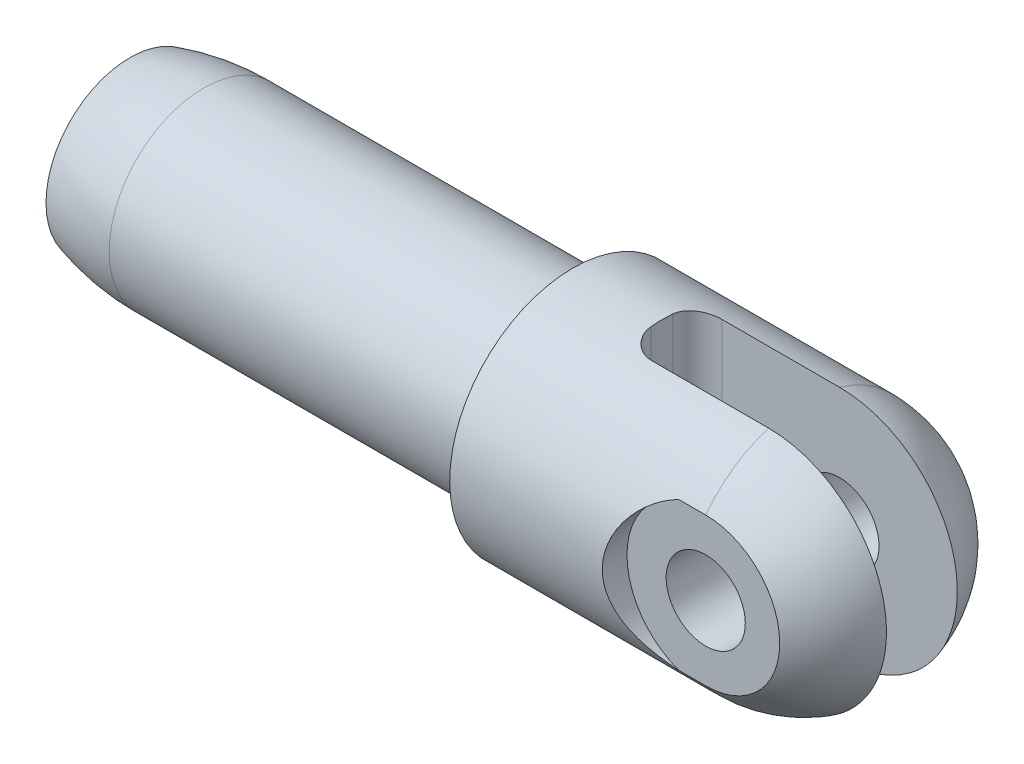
ISO-10303-21;
HEADER;
FILE_DESCRIPTION(('STEP AP214'),'2;1');
FILE_NAME('part.step','',(''),(''),'','','');
FILE_SCHEMA(('AUTOMOTIVE_DESIGN { 1 0 10303 214 1 1 1 1 }'));
ENDSEC;
DATA;
#1=APPLICATION_CONTEXT('core data for automotive mechanical design processes');
#2=APPLICATION_PROTOCOL_DEFINITION('international standard','automotive_design',2000,#1);
#3=PRODUCT_CONTEXT('',#1,'mechanical');
#4=PRODUCT('Part','Part','',(#3));
#5=PRODUCT_RELATED_PRODUCT_CATEGORY('part','',(#4));
#6=PRODUCT_DEFINITION_FORMATION('','',#4);
#7=PRODUCT_DEFINITION_CONTEXT('part definition',#1,'design');
#8=PRODUCT_DEFINITION('design','',#6,#7);
#9=PRODUCT_DEFINITION_SHAPE('','',#8);
#10=(LENGTH_UNIT() NAMED_UNIT(*) SI_UNIT(.MILLI.,.METRE.));
#11=(NAMED_UNIT(*) PLANE_ANGLE_UNIT() SI_UNIT($,.RADIAN.));
#12=(NAMED_UNIT(*) SI_UNIT($,.STERADIAN.) SOLID_ANGLE_UNIT());
#13=UNCERTAINTY_MEASURE_WITH_UNIT(LENGTH_MEASURE(1.E-05),#10,'distance_accuracy_value','');
#14=(GEOMETRIC_REPRESENTATION_CONTEXT(3) GLOBAL_UNCERTAINTY_ASSIGNED_CONTEXT((#13)) GLOBAL_UNIT_ASSIGNED_CONTEXT((#10,
#11,#12)) REPRESENTATION_CONTEXT('',''));
#15=CARTESIAN_POINT('',(0.,0.,0.));
#16=DIRECTION('',(0.,0.,1.));
#17=DIRECTION('',(1.,0.,0.));
#18=AXIS2_PLACEMENT_3D('',#15,#16,#17);
#19=CARTESIAN_POINT('',(-13.6525,0.,0.));
#20=DIRECTION('',(-1.,0.,0.));
#21=DIRECTION('',(0.,0.,-1.));
#22=AXIS2_PLACEMENT_3D('',#19,#20,#21);
#23=SPHERICAL_SURFACE('',#22,7.93749999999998);
#24=CARTESIAN_POINT('',(-13.6525,0.,6.34238));
#25=DIRECTION('',(0.,0.,-1.));
#26=DIRECTION('',(-1.,0.,0.));
#27=AXIS2_PLACEMENT_3D('',#24,#25,#26);
#28=CIRCLE('',#27,4.77264310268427);
#29=CARTESIAN_POINT('',(-13.6525,-4.77264310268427,6.34238));
#30=VERTEX_POINT('',#29);
#31=CARTESIAN_POINT('',(-13.6525,4.77264310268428,6.34237999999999));
#32=VERTEX_POINT('',#31);
#33=EDGE_CURVE('E40',#30,#32,#28,.F.);
#34=ORIENTED_EDGE('',*,*,#33,.F.);
#35=CARTESIAN_POINT('',(-13.6525,0.,0.));
#36=DIRECTION('',(-1.,0.,0.));
#37=DIRECTION('',(0.,0.,1.));
#38=AXIS2_PLACEMENT_3D('',#35,#36,#37);
#39=CIRCLE('',#38,7.93749999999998);
#40=CARTESIAN_POINT('',(-13.6525,-7.60119137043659,2.286));
#41=VERTEX_POINT('',#40);
#42=EDGE_CURVE('E109',#41,#30,#39,.T.);
#43=ORIENTED_EDGE('',*,*,#42,.F.);
#44=CARTESIAN_POINT('',(-13.6525,0.,2.286));
#45=DIRECTION('',(0.,0.,1.));
#46=DIRECTION('',(1.,0.,0.));
#47=AXIS2_PLACEMENT_3D('',#44,#45,#46);
#48=CIRCLE('',#47,7.60119137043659);
#49=CARTESIAN_POINT('',(-13.6525,7.60119137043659,2.286));
#50=VERTEX_POINT('',#49);
#51=EDGE_CURVE('E165',#50,#41,#48,.F.);
#52=ORIENTED_EDGE('',*,*,#51,.F.);
#53=EDGE_CURVE('E110',#32,#50,#39,.T.);
#54=ORIENTED_EDGE('',*,*,#53,.F.);
#55=EDGE_LOOP('',(#34,#43,#52,#54));
#56=FACE_BOUND('',#55,.T.);
#57=ADVANCED_FACE('F15',(#56),#23,.T.);
#58=CARTESIAN_POINT('',(-57.15,0.,0.));
#59=DIRECTION('',(-1.,0.,0.));
#60=DIRECTION('',(0.,0.,1.));
#61=AXIS2_PLACEMENT_3D('',#58,#59,#60);
#62=CYLINDRICAL_SURFACE('',#61,7.9375);
#63=CARTESIAN_POINT('',(-28.575,0.,0.));
#64=DIRECTION('',(-1.,0.,0.));
#65=DIRECTION('',(0.,0.,1.));
#66=AXIS2_PLACEMENT_3D('',#63,#64,#65);
#67=CIRCLE('',#66,7.93750000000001);
#68=CARTESIAN_POINT('',(-28.575,0.,7.93750000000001));
#69=VERTEX_POINT('',#68);
#70=EDGE_CURVE('E283',#69,#69,#67,.T.);
#71=ORIENTED_EDGE('',*,*,#70,.F.);
#72=EDGE_LOOP('',(#71));
#73=FACE_BOUND('',#72,.T.);
#74=CARTESIAN_POINT('',(-13.6525,7.60119137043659,-2.286));
#75=VERTEX_POINT('',#74);
#76=CARTESIAN_POINT('',(-13.6525,2.55269999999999,-7.51582523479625));
#77=VERTEX_POINT('',#76);
#78=EDGE_CURVE('E98',#75,#77,#39,.T.);
#79=ORIENTED_EDGE('',*,*,#78,.T.);
#80=CARTESIAN_POINT('',(-13.6525,2.55269999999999,-7.51582523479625));
#81=CARTESIAN_POINT('',(-13.7222960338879,2.55270902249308,-7.5158146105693));
#82=CARTESIAN_POINT('',(-13.7920860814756,2.54983763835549,-7.51679723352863));
#83=CARTESIAN_POINT('',(-13.9311280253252,2.53840431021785,-7.5206699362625));
#84=CARTESIAN_POINT('',(-14.0003800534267,2.52984380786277,-7.52355953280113));
#85=CARTESIAN_POINT('',(-14.1376632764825,2.50713425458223,-7.53115657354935));
#86=CARTESIAN_POINT('',(-14.2056973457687,2.49300091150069,-7.53585890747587));
#87=CARTESIAN_POINT('',(-14.340246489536,2.45928821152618,-7.54692788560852));
#88=CARTESIAN_POINT('',(-14.4067615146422,2.43970867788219,-7.55329458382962));
#89=CARTESIAN_POINT('',(-14.6032774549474,2.37305373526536,-7.57461051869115));
#90=CARTESIAN_POINT('',(-14.730442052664,2.31802971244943,-7.59178708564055));
#91=CARTESIAN_POINT('',(-14.9737471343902,2.18852112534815,-7.63012555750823));
#92=CARTESIAN_POINT('',(-15.0898813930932,2.11402565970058,-7.65128969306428));
#93=CARTESIAN_POINT('',(-15.3120759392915,1.94478991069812,-7.69607646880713));
#94=CARTESIAN_POINT('',(-15.4176805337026,1.8494654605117,-7.71975699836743));
#95=CARTESIAN_POINT('',(-15.6117119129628,1.64252681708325,-7.76641796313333));
#96=CARTESIAN_POINT('',(-15.7001356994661,1.53090978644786,-7.78939827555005));
#97=CARTESIAN_POINT('',(-15.859349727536,1.29123020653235,-7.83273852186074));
#98=CARTESIAN_POINT('',(-15.9296635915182,1.1628361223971,-7.85302194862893));
#99=CARTESIAN_POINT('',(-16.0475142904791,0.895285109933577,-7.88799968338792));
#100=CARTESIAN_POINT('',(-16.0950576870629,0.756131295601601,-7.90269560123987));
#101=CARTESIAN_POINT('',(-16.1644798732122,0.475814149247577,-7.92443165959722));
#102=CARTESIAN_POINT('',(-16.1871437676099,0.334863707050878,-7.93170545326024));
#103=CARTESIAN_POINT('',(-16.2086549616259,0.0509827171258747,-7.93860480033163));
#104=CARTESIAN_POINT('',(-16.2075075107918,-0.091947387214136,-7.93823203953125));
#105=CARTESIAN_POINT('',(-16.1819362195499,-0.370186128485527,-7.93004079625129));
#106=CARTESIAN_POINT('',(-16.1583645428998,-0.505582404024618,-7.92249491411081));
#107=CARTESIAN_POINT('',(-16.0900172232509,-0.770382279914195,-7.90114370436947));
#108=CARTESIAN_POINT('',(-16.0452404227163,-0.899785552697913,-7.88733803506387));
#109=CARTESIAN_POINT('',(-15.935227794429,-1.15085074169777,-7.85466052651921));
#110=CARTESIAN_POINT('',(-15.8697401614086,-1.27239392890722,-7.83572676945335));
#111=CARTESIAN_POINT('',(-15.7203692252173,-1.50302436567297,-7.79477796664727));
#112=CARTESIAN_POINT('',(-15.6364812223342,-1.61210842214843,-7.77276213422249));
#113=CARTESIAN_POINT('',(-15.4483604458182,-1.8197922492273,-7.72684123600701));
#114=CARTESIAN_POINT('',(-15.3433959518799,-1.91772113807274,-7.7028956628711));
#115=CARTESIAN_POINT('',(-15.1182934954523,-2.09481183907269,-7.65663571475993));
#116=CARTESIAN_POINT('',(-14.998150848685,-2.17396783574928,-7.63432184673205));
#117=CARTESIAN_POINT('',(-14.7440846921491,-2.31212129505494,-7.59363371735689));
#118=CARTESIAN_POINT('',(-14.6100027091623,-2.37084409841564,-7.57531428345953));
#119=CARTESIAN_POINT('',(-14.3331895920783,-2.46459128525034,-7.54534011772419));
#120=CARTESIAN_POINT('',(-14.1904723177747,-2.49965260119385,-7.53367500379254));
#121=CARTESIAN_POINT('',(-13.9807346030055,-2.53236915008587,-7.52270597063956));
#122=CARTESIAN_POINT('',(-13.9153032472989,-2.53999094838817,-7.52013238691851));
#123=CARTESIAN_POINT('',(-13.7840927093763,-2.55015256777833,-7.5166912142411));
#124=CARTESIAN_POINT('',(-13.7183141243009,-2.55269931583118,-7.5158212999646));
#125=CARTESIAN_POINT('',(-13.6525,-2.55269999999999,-7.51582523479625));
#126=B_SPLINE_CURVE_WITH_KNOTS('',3,(#80,#81,#82,#83,#84,#85,#86,#87,#88,#89,#90,#91,#92,#93,
#94,#95,#96,#97,#98,#99,#100,#101,#102,#103,#104,#105,#106,#107,#108,#109,#110,#111,#112,#113,
#114,#115,#116,#117,#118,#119,#120,#121,#122,#123,#124,#125),.UNSPECIFIED.,.F.,.F.,(4,2,2,2,2,2,
2,2,2,2,2,2,2,2,2,2,2,2,2,2,2,2,4),(0.,0.209312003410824,0.418570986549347,0.627244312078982,
0.835924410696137,1.25270448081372,1.6697183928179,2.10041801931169,2.53119274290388,
2.9723501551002,3.41338036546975,3.84005320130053,4.2666319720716,4.67762150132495,
5.08863346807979,5.50484822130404,5.92116940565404,6.35577525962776,6.79051557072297,
7.23089225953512,7.67057997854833,7.86816732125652,8.0654847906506),.UNSPECIFIED.);
#127=CARTESIAN_POINT('',(-13.6525,-2.55269999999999,-7.51582523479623));
#128=VERTEX_POINT('',#127);
#129=EDGE_CURVE('E10',#77,#128,#126,.T.);
#130=ORIENTED_EDGE('',*,*,#129,.T.);
#131=CARTESIAN_POINT('',(-13.6525,-7.60119137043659,-2.286));
#132=VERTEX_POINT('',#131);
#133=EDGE_CURVE('E99',#128,#132,#39,.T.);
#134=ORIENTED_EDGE('',*,*,#133,.T.);
#135=DIRECTION('',(-1.,0.,0.));
#136=VECTOR('',#135,1.);
#137=CARTESIAN_POINT('',(-57.15,-7.60119137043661,-2.28599999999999));
#138=LINE('',#137,#136);
#139=CARTESIAN_POINT('',(-21.2287612,-7.60119137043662,-2.286));
#140=VERTEX_POINT('',#139);
#141=EDGE_CURVE('E123',#132,#140,#138,.T.);
#142=ORIENTED_EDGE('',*,*,#141,.T.);
#143=CARTESIAN_POINT('',(-21.2287612,-7.60119137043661,-2.286));
#144=CARTESIAN_POINT('',(-21.2723240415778,-7.60118888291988,-2.28600076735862));
#145=CARTESIAN_POINT('',(-21.3158651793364,-7.60173122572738,-2.28420571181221));
#146=CARTESIAN_POINT('',(-21.4026192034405,-7.60387818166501,-2.27705152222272));
#147=CARTESIAN_POINT('',(-21.4458321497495,-7.6054825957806,-2.27169305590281));
#148=CARTESIAN_POINT('',(-21.5743013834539,-7.6118346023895,-2.25035848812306));
#149=CARTESIAN_POINT('',(-21.6586704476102,-7.6181213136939,-2.22912280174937));
#150=CARTESIAN_POINT('',(-21.8224517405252,-7.63421803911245,-2.17335028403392));
#151=CARTESIAN_POINT('',(-21.9018648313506,-7.64402743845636,-2.13881577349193));
#152=CARTESIAN_POINT('',(-22.0537814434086,-7.66631016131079,-2.0575144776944));
#153=CARTESIAN_POINT('',(-22.1262825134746,-7.67878442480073,-2.01074337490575));
#154=CARTESIAN_POINT('',(-22.2642522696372,-7.70570588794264,-1.905004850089));
#155=CARTESIAN_POINT('',(-22.3295057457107,-7.72019385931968,-1.84576725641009));
#156=CARTESIAN_POINT('',(-22.4492959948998,-7.7497593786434,-1.71740153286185));
#157=CARTESIAN_POINT('',(-22.503829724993,-7.7648370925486,-1.64827060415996));
#158=CARTESIAN_POINT('',(-22.6021942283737,-7.79490581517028,-1.4997493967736));
#159=CARTESIAN_POINT('',(-22.6456683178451,-7.80988159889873,-1.42011953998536));
#160=CARTESIAN_POINT('',(-22.7184940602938,-7.83820273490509,-1.25440504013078));
#161=CARTESIAN_POINT('',(-22.7478555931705,-7.85154922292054,-1.16832496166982));
#162=CARTESIAN_POINT('',(-22.7850993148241,-7.87219899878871,-1.01800664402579));
#163=CARTESIAN_POINT('',(-22.7967551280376,-7.88012681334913,-0.954764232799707));
#164=CARTESIAN_POINT('',(-22.8123405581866,-7.89454169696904,-0.827217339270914));
#165=CARTESIAN_POINT('',(-22.8162752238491,-7.90102970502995,-0.762913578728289));
#166=CARTESIAN_POINT('',(-22.8162612,-7.90670626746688,-0.698499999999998));
#167=B_SPLINE_CURVE_WITH_KNOTS('',3,(#143,#144,#145,#146,#147,#148,#149,#150,#151,#152,#153,
#154,#155,#156,#157,#158,#159,#160,#161,#162,#163,#164,#165,#166),.UNSPECIFIED.,.F.,.F.,(4,2,2,
2,2,2,2,2,2,2,2,4),(0.,0.130605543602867,0.261186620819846,0.521512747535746,0.781793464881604,
1.04216614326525,1.30890313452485,1.5757157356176,1.85027427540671,2.12464032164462,
2.31856344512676,2.51235972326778),.UNSPECIFIED.);
#168=CARTESIAN_POINT('',(-22.8162612,-7.90670626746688,-0.698499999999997));
#169=VERTEX_POINT('',#168);
#170=EDGE_CURVE('E164',#140,#169,#167,.T.);
#171=ORIENTED_EDGE('',*,*,#170,.T.);
#172=CARTESIAN_POINT('',(-22.8162612,0.,0.));
#173=DIRECTION('',(-1.,0.,0.));
#174=DIRECTION('',(0.,0.,1.));
#175=AXIS2_PLACEMENT_3D('',#172,#173,#174);
#176=CIRCLE('',#175,7.9375);
#177=CARTESIAN_POINT('',(-22.8162612,-7.90670626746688,0.698500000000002));
#178=VERTEX_POINT('',#177);
#179=EDGE_CURVE('E198',#169,#178,#176,.T.);
#180=ORIENTED_EDGE('',*,*,#179,.T.);
#181=CARTESIAN_POINT('',(-22.8162612,-7.90670626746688,0.698500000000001));
#182=CARTESIAN_POINT('',(-22.8162613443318,-7.90274986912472,0.743309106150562));
#183=CARTESIAN_POINT('',(-22.8143629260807,-7.89840985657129,0.788060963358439));
#184=CARTESIAN_POINT('',(-22.8068094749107,-7.88901098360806,0.877162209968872));
#185=CARTESIAN_POINT('',(-22.8011551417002,-7.8839522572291,0.921511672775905));
#186=CARTESIAN_POINT('',(-22.7786570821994,-7.86779622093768,1.0533204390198));
#187=CARTESIAN_POINT('',(-22.7562778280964,-7.85569793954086,1.13977644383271));
#188=CARTESIAN_POINT('',(-22.6975333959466,-7.82954781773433,1.30740367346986));
#189=CARTESIAN_POINT('',(-22.6611705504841,-7.8154963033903,1.38857577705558));
#190=CARTESIAN_POINT('',(-22.5755248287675,-7.7863580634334,1.54361885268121));
#191=CARTESIAN_POINT('',(-22.5262386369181,-7.7712710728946,1.61748794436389));
#192=CARTESIAN_POINT('',(-22.4150912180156,-7.74088462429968,1.75721981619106));
#193=CARTESIAN_POINT('',(-22.3530248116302,-7.72558607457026,1.82291965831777));
#194=CARTESIAN_POINT('',(-22.2184708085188,-7.69626643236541,1.94299195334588));
#195=CARTESIAN_POINT('',(-22.145981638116,-7.68224553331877,1.99736269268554));
#196=CARTESIAN_POINT('',(-21.9925159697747,-7.65670576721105,2.09313825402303));
#197=CARTESIAN_POINT('',(-21.9115418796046,-7.64518619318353,2.13454674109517));
#198=CARTESIAN_POINT('',(-21.7433726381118,-7.62574114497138,2.2030105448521));
#199=CARTESIAN_POINT('',(-21.6561840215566,-7.61781195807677,2.23008069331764));
#200=CARTESIAN_POINT('',(-21.5117397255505,-7.60849396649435,2.26161085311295));
#201=CARTESIAN_POINT('',(-21.4555480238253,-7.60576709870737,2.27074472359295));
#202=CARTESIAN_POINT('',(-21.3425017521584,-7.60211143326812,2.28294121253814));
#203=CARTESIAN_POINT('',(-21.2856477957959,-7.60118108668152,2.28600906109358));
#204=CARTESIAN_POINT('',(-21.2287612,-7.60119137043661,2.286));
#205=B_SPLINE_CURVE_WITH_KNOTS('',3,(#181,#182,#183,#184,#185,#186,#187,#188,#189,#190,#191,
#192,#193,#194,#195,#196,#197,#198,#199,#200,#201,#202,#203,#204),.UNSPECIFIED.,.F.,.F.,(4,2,2,
2,2,2,2,2,2,2,2,4),(0.,0.134863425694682,0.269701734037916,0.53867581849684,0.80760505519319,
1.0766033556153,1.35031433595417,1.62406668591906,1.89774156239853,2.17113279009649,
2.34178737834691,2.5122947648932),.UNSPECIFIED.);
#206=CARTESIAN_POINT('',(-21.2287612,-7.60119137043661,2.286));
#207=VERTEX_POINT('',#206);
#208=EDGE_CURVE('E203',#178,#207,#205,.T.);
#209=ORIENTED_EDGE('',*,*,#208,.T.);
#210=DIRECTION('',(-1.,0.,0.));
#211=VECTOR('',#210,1.);
#212=CARTESIAN_POINT('',(-57.15,-7.60119137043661,2.28600000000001));
#213=LINE('',#212,#211);
#214=EDGE_CURVE('E120',#207,#41,#213,.F.);
#215=ORIENTED_EDGE('',*,*,#214,.T.);
#216=ORIENTED_EDGE('',*,*,#42,.T.);
#217=DIRECTION('',(-1.,0.,0.));
#218=VECTOR('',#217,1.);
#219=CARTESIAN_POINT('',(-57.15,-4.77264310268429,6.34238000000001));
#220=LINE('',#219,#218);
#221=CARTESIAN_POINT('',(-15.3926947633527,-4.77264310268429,6.34238));
#222=VERTEX_POINT('',#221);
#223=EDGE_CURVE('E27',#30,#222,#220,.T.);
#224=ORIENTED_EDGE('',*,*,#223,.T.);
#225=CARTESIAN_POINT('',(-15.3926947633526,-4.77264310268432,6.34237999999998));
#226=CARTESIAN_POINT('',(-15.5334553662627,-4.72131093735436,6.38101004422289));
#227=CARTESIAN_POINT('',(-15.6710232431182,-4.66410489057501,6.42308173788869));
#228=CARTESIAN_POINT('',(-15.9391567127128,-4.53866781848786,6.51231928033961));
#229=CARTESIAN_POINT('',(-16.0697286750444,-4.4704470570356,6.5594803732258));
#230=CARTESIAN_POINT('',(-16.3235094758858,-4.32360960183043,6.65718306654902));
#231=CARTESIAN_POINT('',(-16.4467187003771,-4.24499345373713,6.70772448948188));
#232=CARTESIAN_POINT('',(-16.6854537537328,-4.07784627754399,6.81063206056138));
#233=CARTESIAN_POINT('',(-16.8009775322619,-3.98931262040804,6.86299869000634));
#234=CARTESIAN_POINT('',(-17.0235847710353,-3.80304950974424,6.96793466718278));
#235=CARTESIAN_POINT('',(-17.1306926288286,-3.70534858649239,7.0205029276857));
#236=CARTESIAN_POINT('',(-17.3364055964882,-3.50089516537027,7.12466147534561));
#237=CARTESIAN_POINT('',(-17.435011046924,-3.39414303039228,7.17625180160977));
#238=CARTESIAN_POINT('',(-17.6232267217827,-3.17189870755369,7.27721563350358));
#239=CARTESIAN_POINT('',(-17.7128327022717,-3.05640244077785,7.32658808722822));
#240=CARTESIAN_POINT('',(-17.8823509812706,-2.81713605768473,7.42187523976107));
#241=CARTESIAN_POINT('',(-17.9622627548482,-2.69336549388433,7.46778975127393));
#242=CARTESIAN_POINT('',(-18.1131903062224,-2.43545136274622,7.55588723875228));
#243=CARTESIAN_POINT('',(-18.1839870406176,-2.30114582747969,7.59797299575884));
#244=CARTESIAN_POINT('',(-18.3137882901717,-2.02534024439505,7.67609467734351));
#245=CARTESIAN_POINT('',(-18.372799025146,-1.88384404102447,7.71213379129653));
#246=CARTESIAN_POINT('',(-18.4781258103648,-1.59479349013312,7.77704649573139));
#247=CARTESIAN_POINT('',(-18.5244565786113,-1.44724639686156,7.80592839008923));
#248=CARTESIAN_POINT('',(-18.603683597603,-1.14727033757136,7.85562031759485));
#249=CARTESIAN_POINT('',(-18.6365828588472,-0.994842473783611,7.87643215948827));
#250=CARTESIAN_POINT('',(-18.68441043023,-0.70986460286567,7.90679108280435));
#251=CARTESIAN_POINT('',(-18.7012964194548,-0.577769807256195,7.91756101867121));
#252=CARTESIAN_POINT('',(-18.7246414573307,-0.312295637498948,7.93246764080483));
#253=CARTESIAN_POINT('',(-18.7311017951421,-0.178916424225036,7.93660514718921));
#254=CARTESIAN_POINT('',(-18.7334908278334,0.0879343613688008,7.9381341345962));
#255=CARTESIAN_POINT('',(-18.7294225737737,0.221405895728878,7.93552756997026));
#256=CARTESIAN_POINT('',(-18.7108285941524,0.487313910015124,7.9236445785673));
#257=CARTESIAN_POINT('',(-18.6963032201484,0.619750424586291,7.91436837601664));
#258=CARTESIAN_POINT('',(-18.6588630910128,0.870186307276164,7.89056331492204));
#259=CARTESIAN_POINT('',(-18.6368597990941,0.988377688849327,7.87660671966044));
#260=CARTESIAN_POINT('',(-18.5847262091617,1.22226066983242,7.8437209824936));
#261=CARTESIAN_POINT('',(-18.5545934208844,1.33795149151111,7.82479031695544));
#262=CARTESIAN_POINT('',(-18.4525094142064,1.68013329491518,7.76110292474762));
#263=CARTESIAN_POINT('',(-18.3688368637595,1.90196721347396,7.70942751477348));
#264=CARTESIAN_POINT('',(-18.1674288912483,2.34179996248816,7.58783595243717));
#265=CARTESIAN_POINT('',(-18.0479005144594,2.5587047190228,7.51698616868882));
#266=CARTESIAN_POINT('',(-17.7808727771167,2.97039005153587,7.36403315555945));
#267=CARTESIAN_POINT('',(-17.6333416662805,3.16514510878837,7.28191718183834));
#268=CARTESIAN_POINT('',(-17.2892360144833,3.55791082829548,7.09921868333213));
#269=CARTESIAN_POINT('',(-17.0886180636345,3.75195102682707,6.99772248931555));
#270=CARTESIAN_POINT('',(-16.6580691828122,4.10491003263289,6.7966734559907));
#271=CARTESIAN_POINT('',(-16.4281811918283,4.26387937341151,6.69711801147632));
#272=CARTESIAN_POINT('',(-16.0597434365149,4.47576457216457,6.55583609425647));
#273=CARTESIAN_POINT('',(-15.9309162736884,4.54274245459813,6.50946468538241));
#274=CARTESIAN_POINT('',(-15.6666686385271,4.6659118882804,6.42174988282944));
#275=CARTESIAN_POINT('',(-15.5312515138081,4.72210884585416,6.38040397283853));
#276=CARTESIAN_POINT('',(-15.3926947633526,4.77264310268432,6.34237999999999));
#277=B_SPLINE_CURVE_WITH_KNOTS('',3,(#225,#226,#227,#228,#229,#230,#231,#232,#233,#234,#235,
#236,#237,#238,#239,#240,#241,#242,#243,#244,#245,#246,#247,#248,#249,#250,#251,#252,#253,#254,
#255,#256,#257,#258,#259,#260,#261,#262,#263,#264,#265,#266,#267,#268,#269,#270,#271,#272,#273,
#274,#275,#276),.UNSPECIFIED.,.F.,.F.,(4,2,2,2,2,2,2,2,2,2,2,2,2,2,2,2,2,2,2,2,2,2,2,2,2,4),(0.,
0.463864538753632,0.927299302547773,1.39070975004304,1.85424333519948,2.31637935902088,
2.77849686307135,3.24083127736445,3.7031907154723,4.17514579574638,4.64685114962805,
5.11800663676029,5.58905646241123,5.98931668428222,6.38952740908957,6.78962217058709,
7.18970348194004,7.55237461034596,7.91515696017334,8.64001754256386,9.4099019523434,
10.1806645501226,11.068109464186,11.9542671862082,12.4110005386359,12.8675042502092),.UNSPECIFIED.);
#278=CARTESIAN_POINT('',(-15.3926947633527,4.77264310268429,6.34238));
#279=VERTEX_POINT('',#278);
#280=EDGE_CURVE('E226',#222,#279,#277,.T.);
#281=ORIENTED_EDGE('',*,*,#280,.T.);
#282=DIRECTION('',(-1.,0.,0.));
#283=VECTOR('',#282,1.);
#284=CARTESIAN_POINT('',(-57.15,4.77264310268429,6.34238000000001));
#285=LINE('',#284,#283);
#286=EDGE_CURVE('E209',#279,#32,#285,.F.);
#287=ORIENTED_EDGE('',*,*,#286,.T.);
#288=ORIENTED_EDGE('',*,*,#53,.T.);
#289=DIRECTION('',(-1.,0.,0.));
#290=VECTOR('',#289,1.);
#291=CARTESIAN_POINT('',(-57.15,7.60119137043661,2.28600000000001));
#292=LINE('',#291,#290);
#293=CARTESIAN_POINT('',(-21.2287612,7.60119137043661,2.286));
#294=VERTEX_POINT('',#293);
#295=EDGE_CURVE('E116',#50,#294,#292,.T.);
#296=ORIENTED_EDGE('',*,*,#295,.T.);
#297=CARTESIAN_POINT('',(-21.2287612,7.60119137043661,2.286));
#298=CARTESIAN_POINT('',(-21.2723240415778,7.60118888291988,2.28600076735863));
#299=CARTESIAN_POINT('',(-21.3158651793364,7.60173122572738,2.28420571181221));
#300=CARTESIAN_POINT('',(-21.4026192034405,7.60387818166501,2.27705152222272));
#301=CARTESIAN_POINT('',(-21.4458321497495,7.6054825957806,2.27169305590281));
#302=CARTESIAN_POINT('',(-21.5743013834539,7.6118346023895,2.25035848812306));
#303=CARTESIAN_POINT('',(-21.6586704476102,7.6181213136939,2.22912280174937));
#304=CARTESIAN_POINT('',(-21.8224517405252,7.63421803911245,2.17335028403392));
#305=CARTESIAN_POINT('',(-21.9018648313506,7.64402743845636,2.13881577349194));
#306=CARTESIAN_POINT('',(-22.0537814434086,7.66631016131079,2.0575144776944));
#307=CARTESIAN_POINT('',(-22.1262825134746,7.67878442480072,2.01074337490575));
#308=CARTESIAN_POINT('',(-22.2642522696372,7.70570588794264,1.905004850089));
#309=CARTESIAN_POINT('',(-22.3295057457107,7.72019385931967,1.84576725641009));
#310=CARTESIAN_POINT('',(-22.4492959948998,7.7497593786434,1.71740153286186));
#311=CARTESIAN_POINT('',(-22.503829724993,7.7648370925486,1.64827060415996));
#312=CARTESIAN_POINT('',(-22.6021942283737,7.79490581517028,1.4997493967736));
#313=CARTESIAN_POINT('',(-22.6456683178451,7.80988159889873,1.42011953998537));
#314=CARTESIAN_POINT('',(-22.7184940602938,7.83820273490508,1.25440504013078));
#315=CARTESIAN_POINT('',(-22.7478555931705,7.85154922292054,1.16832496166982));
#316=CARTESIAN_POINT('',(-22.7850993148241,7.87219899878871,1.01800664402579));
#317=CARTESIAN_POINT('',(-22.7967551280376,7.88012681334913,0.954764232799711));
#318=CARTESIAN_POINT('',(-22.8123405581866,7.89454169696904,0.827217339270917));
#319=CARTESIAN_POINT('',(-22.8162752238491,7.90102970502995,0.762913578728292));
#320=CARTESIAN_POINT('',(-22.8162612,7.90670626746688,0.698500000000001));
#321=B_SPLINE_CURVE_WITH_KNOTS('',3,(#297,#298,#299,#300,#301,#302,#303,#304,#305,#306,#307,
#308,#309,#310,#311,#312,#313,#314,#315,#316,#317,#318,#319,#320),.UNSPECIFIED.,.F.,.F.,(4,2,2,
2,2,2,2,2,2,2,2,4),(0.,0.130605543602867,0.261186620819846,0.521512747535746,0.781793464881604,
1.04216614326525,1.30890313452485,1.5757157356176,1.85027427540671,2.12464032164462,
2.31856344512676,2.51235972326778),.UNSPECIFIED.);
#322=CARTESIAN_POINT('',(-22.8162612,7.90670626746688,0.698500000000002));
#323=VERTEX_POINT('',#322);
#324=EDGE_CURVE('E199',#294,#323,#321,.T.);
#325=ORIENTED_EDGE('',*,*,#324,.T.);
#326=CARTESIAN_POINT('',(-22.8162612,7.90670626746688,-0.698499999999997));
#327=VERTEX_POINT('',#326);
#328=EDGE_CURVE('E180',#323,#327,#176,.T.);
#329=ORIENTED_EDGE('',*,*,#328,.T.);
#330=CARTESIAN_POINT('',(-22.8162612,7.90670626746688,-0.698499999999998));
#331=CARTESIAN_POINT('',(-22.8162613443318,7.90274986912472,-0.743309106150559));
#332=CARTESIAN_POINT('',(-22.8143629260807,7.89840985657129,-0.788060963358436));
#333=CARTESIAN_POINT('',(-22.8068094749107,7.88901098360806,-0.877162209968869));
#334=CARTESIAN_POINT('',(-22.8011551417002,7.8839522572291,-0.921511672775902));
#335=CARTESIAN_POINT('',(-22.7786570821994,7.86779622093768,-1.05332043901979));
#336=CARTESIAN_POINT('',(-22.7562778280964,7.85569793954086,-1.1397764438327));
#337=CARTESIAN_POINT('',(-22.6975333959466,7.82954781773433,-1.30740367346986));
#338=CARTESIAN_POINT('',(-22.6611705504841,7.8154963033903,-1.38857577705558));
#339=CARTESIAN_POINT('',(-22.5755248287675,7.7863580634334,-1.54361885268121));
#340=CARTESIAN_POINT('',(-22.5262386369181,7.7712710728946,-1.61748794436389));
#341=CARTESIAN_POINT('',(-22.4150912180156,7.74088462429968,-1.75721981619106));
#342=CARTESIAN_POINT('',(-22.3530248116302,7.72558607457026,-1.82291965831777));
#343=CARTESIAN_POINT('',(-22.2184708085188,7.69626643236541,-1.94299195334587));
#344=CARTESIAN_POINT('',(-22.145981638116,7.68224553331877,-1.99736269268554));
#345=CARTESIAN_POINT('',(-21.9925159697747,7.65670576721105,-2.09313825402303));
#346=CARTESIAN_POINT('',(-21.9115418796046,7.64518619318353,-2.13454674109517));
#347=CARTESIAN_POINT('',(-21.7433726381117,7.62574114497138,-2.20301054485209));
#348=CARTESIAN_POINT('',(-21.6561840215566,7.61781195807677,-2.23008069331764));
#349=CARTESIAN_POINT('',(-21.5117397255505,7.60849396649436,-2.26161085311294));
#350=CARTESIAN_POINT('',(-21.4555480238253,7.60576709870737,-2.27074472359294));
#351=CARTESIAN_POINT('',(-21.3425017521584,7.60211143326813,-2.28294121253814));
#352=CARTESIAN_POINT('',(-21.2856477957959,7.60118108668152,-2.28600906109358));
#353=CARTESIAN_POINT('',(-21.2287612,7.60119137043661,-2.286));
#354=B_SPLINE_CURVE_WITH_KNOTS('',3,(#330,#331,#332,#333,#334,#335,#336,#337,#338,#339,#340,
#341,#342,#343,#344,#345,#346,#347,#348,#349,#350,#351,#352,#353),.UNSPECIFIED.,.F.,.F.,(4,2,2,
2,2,2,2,2,2,2,2,4),(0.,0.134863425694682,0.269701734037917,0.53867581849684,0.807605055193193,
1.0766033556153,1.35031433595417,1.62406668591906,1.89774156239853,2.17113279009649,
2.34178737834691,2.5122947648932),.UNSPECIFIED.);
#355=CARTESIAN_POINT('',(-21.2287612,7.6011913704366,-2.286));
#356=VERTEX_POINT('',#355);
#357=EDGE_CURVE('E168',#327,#356,#354,.T.);
#358=ORIENTED_EDGE('',*,*,#357,.T.);
#359=DIRECTION('',(-1.,0.,0.));
#360=VECTOR('',#359,1.);
#361=CARTESIAN_POINT('',(-57.15,7.60119137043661,-2.28599999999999));
#362=LINE('',#361,#360);
#363=EDGE_CURVE('E106',#356,#75,#362,.F.);
#364=ORIENTED_EDGE('',*,*,#363,.T.);
#365=EDGE_LOOP('',(#79,#130,#134,#142,#171,#180,#209,#215,#216,#224,#281,#287,#288,#296,#325,
#329,#358,#364));
#366=FACE_BOUND('',#365,.T.);
#367=ADVANCED_FACE('F104',(#73,#366),#62,.T.);
#368=CARTESIAN_POINT('',(-57.15,0.,0.));
#369=DIRECTION('',(-1.,0.,0.));
#370=DIRECTION('',(0.,0.,1.));
#371=AXIS2_PLACEMENT_3D('',#368,#369,#370);
#372=CYLINDRICAL_SURFACE('',#371,6.096);
#373=CARTESIAN_POINT('',(-52.3875,0.,0.));
#374=DIRECTION('',(-1.,0.,0.));
#375=DIRECTION('',(0.,0.,1.));
#376=AXIS2_PLACEMENT_3D('',#373,#374,#375);
#377=CIRCLE('',#376,6.096);
#378=CARTESIAN_POINT('',(-52.3875,0.,6.096));
#379=VERTEX_POINT('',#378);
#380=EDGE_CURVE('E166',#379,#379,#377,.T.);
#381=ORIENTED_EDGE('',*,*,#380,.F.);
#382=EDGE_LOOP('',(#381));
#383=FACE_BOUND('',#382,.T.);
#384=CARTESIAN_POINT('',(-28.575,0.,0.));
#385=DIRECTION('',(-1.,0.,0.));
#386=DIRECTION('',(0.,0.,1.));
#387=AXIS2_PLACEMENT_3D('',#384,#385,#386);
#388=CIRCLE('',#387,6.096);
#389=CARTESIAN_POINT('',(-28.575,0.,6.096));
#390=VERTEX_POINT('',#389);
#391=EDGE_CURVE('E171',#390,#390,#388,.T.);
#392=ORIENTED_EDGE('',*,*,#391,.T.);
#393=EDGE_LOOP('',(#392));
#394=FACE_BOUND('',#393,.T.);
#395=ADVANCED_FACE('F250',(#383,#394),#372,.T.);
#396=CARTESIAN_POINT('',(-28.575,0.,-6.096));
#397=DIRECTION('',(-1.,0.,0.));
#398=DIRECTION('',(0.,0.,1.));
#399=AXIS2_PLACEMENT_3D('',#396,#397,#398);
#400=PLANE('',#399);
#401=ORIENTED_EDGE('',*,*,#70,.T.);
#402=EDGE_LOOP('',(#401));
#403=FACE_BOUND('',#402,.T.);
#404=ORIENTED_EDGE('',*,*,#391,.F.);
#405=EDGE_LOOP('',(#404));
#406=FACE_BOUND('',#405,.T.);
#407=ADVANCED_FACE('F254',(#403,#406),#400,.T.);
#408=CARTESIAN_POINT('',(-13.6525,0.,-7.51582523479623));
#409=DIRECTION('',(0.,0.,1.));
#410=DIRECTION('',(1.,0.,0.));
#411=AXIS2_PLACEMENT_3D('',#408,#409,#410);
#412=CIRCLE('',#411,2.55269999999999);
#413=EDGE_CURVE('E33',#77,#128,#412,.F.);
#414=ORIENTED_EDGE('',*,*,#413,.F.);
#415=ORIENTED_EDGE('',*,*,#78,.F.);
#416=CARTESIAN_POINT('',(-13.6525,0.,-2.286));
#417=DIRECTION('',(0.,0.,-1.));
#418=DIRECTION('',(-1.,0.,0.));
#419=AXIS2_PLACEMENT_3D('',#416,#417,#418);
#420=CIRCLE('',#419,7.60119137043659);
#421=EDGE_CURVE('E161',#132,#75,#420,.F.);
#422=ORIENTED_EDGE('',*,*,#421,.F.);
#423=ORIENTED_EDGE('',*,*,#133,.F.);
#424=EDGE_LOOP('',(#414,#415,#422,#423));
#425=FACE_BOUND('',#424,.T.);
#426=ADVANCED_FACE('F96',(#425),#23,.T.);
#427=CARTESIAN_POINT('',(-21.2287612,-127.,0.698500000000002));
#428=DIRECTION('',(0.,1.,0.));
#429=DIRECTION('',(0.,0.,1.));
#430=AXIS2_PLACEMENT_3D('',#427,#428,#429);
#431=CYLINDRICAL_SURFACE('',#430,1.5875);
#432=DIRECTION('',(0.,1.,0.));
#433=VECTOR('',#432,1.);
#434=CARTESIAN_POINT('',(-21.2287612,-127.,2.286));
#435=LINE('',#434,#433);
#436=EDGE_CURVE('E129',#207,#294,#435,.T.);
#437=ORIENTED_EDGE('',*,*,#436,.F.);
#438=ORIENTED_EDGE('',*,*,#208,.F.);
#439=DIRECTION('',(0.,1.,0.));
#440=VECTOR('',#439,1.);
#441=CARTESIAN_POINT('',(-22.8162612,-127.,0.698500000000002));
#442=LINE('',#441,#440);
#443=EDGE_CURVE('E136',#178,#323,#442,.T.);
#444=ORIENTED_EDGE('',*,*,#443,.T.);
#445=ORIENTED_EDGE('',*,*,#324,.F.);
#446=EDGE_LOOP('',(#437,#438,#444,#445));
#447=FACE_BOUND('',#446,.T.);
#448=ADVANCED_FACE('F211',(#447),#431,.F.);
#449=CARTESIAN_POINT('',(-22.8162612,-127.,-0.698499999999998));
#450=DIRECTION('',(-1.,0.,0.));
#451=DIRECTION('',(0.,0.,1.));
#452=AXIS2_PLACEMENT_3D('',#449,#450,#451);
#453=PLANE('',#452);
#454=ORIENTED_EDGE('',*,*,#443,.F.);
#455=ORIENTED_EDGE('',*,*,#179,.F.);
#456=DIRECTION('',(0.,1.,0.));
#457=VECTOR('',#456,1.);
#458=CARTESIAN_POINT('',(-22.8162612,-127.,-0.698499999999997));
#459=LINE('',#458,#457);
#460=EDGE_CURVE('E133',#169,#327,#459,.T.);
#461=ORIENTED_EDGE('',*,*,#460,.T.);
#462=ORIENTED_EDGE('',*,*,#328,.F.);
#463=EDGE_LOOP('',(#454,#455,#461,#462));
#464=FACE_BOUND('',#463,.T.);
#465=ADVANCED_FACE('F188',(#464),#453,.F.);
#466=CARTESIAN_POINT('',(-21.2287612,-127.,-0.698499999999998));
#467=DIRECTION('',(0.,1.,0.));
#468=DIRECTION('',(0.,0.,1.));
#469=AXIS2_PLACEMENT_3D('',#466,#467,#468);
#470=CYLINDRICAL_SURFACE('',#469,1.5875);
#471=ORIENTED_EDGE('',*,*,#460,.F.);
#472=ORIENTED_EDGE('',*,*,#170,.F.);
#473=DIRECTION('',(0.,1.,0.));
#474=VECTOR('',#473,1.);
#475=CARTESIAN_POINT('',(-21.2287612,-127.,-2.286));
#476=LINE('',#475,#474);
#477=EDGE_CURVE('E130',#140,#356,#476,.T.);
#478=ORIENTED_EDGE('',*,*,#477,.T.);
#479=ORIENTED_EDGE('',*,*,#357,.F.);
#480=EDGE_LOOP('',(#471,#472,#478,#479));
#481=FACE_BOUND('',#480,.T.);
#482=ADVANCED_FACE('F184',(#481),#470,.F.);
#483=CARTESIAN_POINT('',(-21.2287612,-127.,2.286));
#484=DIRECTION('',(0.,0.,1.));
#485=DIRECTION('',(1.,0.,0.));
#486=AXIS2_PLACEMENT_3D('',#483,#484,#485);
#487=PLANE('',#486);
#488=CARTESIAN_POINT('',(-13.6525,0.,2.286));
#489=DIRECTION('',(0.,0.,1.));
#490=DIRECTION('',(1.,0.,0.));
#491=AXIS2_PLACEMENT_3D('',#488,#489,#490);
#492=CIRCLE('',#491,2.55269999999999);
#493=CARTESIAN_POINT('',(-11.0998,0.,2.286));
#494=VERTEX_POINT('',#493);
#495=EDGE_CURVE('E145',#494,#494,#492,.T.);
#496=ORIENTED_EDGE('',*,*,#495,.T.);
#497=EDGE_LOOP('',(#496));
#498=FACE_BOUND('',#497,.T.);
#499=ORIENTED_EDGE('',*,*,#51,.T.);
#500=ORIENTED_EDGE('',*,*,#214,.F.);
#501=ORIENTED_EDGE('',*,*,#436,.T.);
#502=ORIENTED_EDGE('',*,*,#295,.F.);
#503=EDGE_LOOP('',(#499,#500,#501,#502));
#504=FACE_BOUND('',#503,.T.);
#505=ADVANCED_FACE('F157',(#498,#504),#487,.F.);
#506=CARTESIAN_POINT('',(-6.05130862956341,-127.,-2.286));
#507=DIRECTION('',(0.,0.,-1.));
#508=DIRECTION('',(-1.,0.,0.));
#509=AXIS2_PLACEMENT_3D('',#506,#507,#508);
#510=PLANE('',#509);
#511=CARTESIAN_POINT('',(-13.6525,0.,-2.286));
#512=DIRECTION('',(0.,0.,1.));
#513=DIRECTION('',(1.,0.,0.));
#514=AXIS2_PLACEMENT_3D('',#511,#512,#513);
#515=CIRCLE('',#514,2.55269999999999);
#516=CARTESIAN_POINT('',(-11.0998,0.,-2.286));
#517=VERTEX_POINT('',#516);
#518=EDGE_CURVE('E101',#517,#517,#515,.T.);
#519=ORIENTED_EDGE('',*,*,#518,.F.);
#520=EDGE_LOOP('',(#519));
#521=FACE_BOUND('',#520,.T.);
#522=ORIENTED_EDGE('',*,*,#141,.F.);
#523=ORIENTED_EDGE('',*,*,#421,.T.);
#524=ORIENTED_EDGE('',*,*,#363,.F.);
#525=ORIENTED_EDGE('',*,*,#477,.F.);
#526=EDGE_LOOP('',(#522,#523,#524,#525));
#527=FACE_BOUND('',#526,.T.);
#528=ADVANCED_FACE('F153',(#521,#527),#510,.F.);
#529=CARTESIAN_POINT('',(-13.6525,0.,260.34238));
#530=DIRECTION('',(0.,0.,-1.));
#531=DIRECTION('',(-1.,0.,0.));
#532=AXIS2_PLACEMENT_3D('',#529,#530,#531);
#533=CYLINDRICAL_SURFACE('',#532,5.08);
#534=CARTESIAN_POINT('',(-13.6525,0.,6.34238));
#535=DIRECTION('',(0.,0.,-1.));
#536=DIRECTION('',(-1.,0.,0.));
#537=AXIS2_PLACEMENT_3D('',#534,#535,#536);
#538=CIRCLE('',#537,5.08);
#539=EDGE_CURVE('E142',#222,#279,#538,.T.);
#540=ORIENTED_EDGE('',*,*,#539,.T.);
#541=ORIENTED_EDGE('',*,*,#280,.F.);
#542=EDGE_LOOP('',(#540,#541));
#543=FACE_BOUND('',#542,.T.);
#544=ADVANCED_FACE('F156',(#543),#533,.F.);
#545=CARTESIAN_POINT('',(-13.6525,0.,6.34238));
#546=DIRECTION('',(0.,0.,-1.));
#547=DIRECTION('',(-1.,0.,0.));
#548=AXIS2_PLACEMENT_3D('',#545,#546,#547);
#549=PLANE('',#548);
#550=CARTESIAN_POINT('',(-13.6525,0.,6.34238));
#551=DIRECTION('',(0.,0.,1.));
#552=DIRECTION('',(1.,0.,0.));
#553=AXIS2_PLACEMENT_3D('',#550,#551,#552);
#554=CIRCLE('',#553,2.55269999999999);
#555=CARTESIAN_POINT('',(-11.0998,0.,6.34238));
#556=VERTEX_POINT('',#555);
#557=EDGE_CURVE('E100',#556,#556,#554,.T.);
#558=ORIENTED_EDGE('',*,*,#557,.F.);
#559=EDGE_LOOP('',(#558));
#560=FACE_BOUND('',#559,.T.);
#561=ORIENTED_EDGE('',*,*,#33,.T.);
#562=ORIENTED_EDGE('',*,*,#286,.F.);
#563=ORIENTED_EDGE('',*,*,#539,.F.);
#564=ORIENTED_EDGE('',*,*,#223,.F.);
#565=EDGE_LOOP('',(#561,#562,#563,#564));
#566=FACE_BOUND('',#565,.T.);
#567=ADVANCED_FACE('F223',(#560,#566),#549,.F.);
#568=CARTESIAN_POINT('',(-13.6525,0.,6.34238));
#569=DIRECTION('',(0.,0.,1.));
#570=DIRECTION('',(1.,0.,0.));
#571=AXIS2_PLACEMENT_3D('',#568,#569,#570);
#572=CYLINDRICAL_SURFACE('',#571,2.55269999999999);
#573=ORIENTED_EDGE('',*,*,#557,.T.);
#574=EDGE_LOOP('',(#573));
#575=FACE_BOUND('',#574,.T.);
#576=ORIENTED_EDGE('',*,*,#495,.F.);
#577=EDGE_LOOP('',(#576));
#578=FACE_BOUND('',#577,.T.);
#579=ADVANCED_FACE('F301',(#575,#578),#572,.F.);
#580=CARTESIAN_POINT('',(-13.6525,0.,-2.286));
#581=DIRECTION('',(0.,0.,1.));
#582=DIRECTION('',(1.,0.,0.));
#583=AXIS2_PLACEMENT_3D('',#580,#581,#582);
#584=CYLINDRICAL_SURFACE('',#583,2.55269999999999);
#585=ORIENTED_EDGE('',*,*,#413,.T.);
#586=ORIENTED_EDGE('',*,*,#129,.F.);
#587=EDGE_LOOP('',(#585,#586));
#588=FACE_BOUND('',#587,.T.);
#589=ORIENTED_EDGE('',*,*,#518,.T.);
#590=EDGE_LOOP('',(#589));
#591=FACE_BOUND('',#590,.T.);
#592=ADVANCED_FACE('F89',(#588,#591),#584,.F.);
#593=CARTESIAN_POINT('',(-25.8125099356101,0.,0.));
#594=DIRECTION('',(-1.,0.,0.));
#595=DIRECTION('',(0.,-1.,0.));
#596=AXIS2_PLACEMENT_3D('',#593,#594,#595);
#597=CONICAL_SURFACE('',#596,0.,1.17809724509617);
#598=CARTESIAN_POINT('',(-27.559,0.,0.));
#599=DIRECTION('',(1.,0.,0.));
#600=DIRECTION('',(0.,1.,0.));
#601=AXIS2_PLACEMENT_3D('',#598,#599,#600);
#602=CIRCLE('',#601,4.2164);
#603=CARTESIAN_POINT('',(-27.559,4.2164,0.));
#604=VERTEX_POINT('',#603);
#605=EDGE_CURVE('E112',#604,#604,#602,.T.);
#606=ORIENTED_EDGE('',*,*,#605,.F.);
#607=EDGE_LOOP('',(#606));
#608=FACE_BOUND('',#607,.T.);
#609=CARTESIAN_POINT('',(-25.8125099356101,0.,0.));
#610=VERTEX_POINT('',#609);
#611=VERTEX_LOOP('',#610);
#612=FACE_BOUND('',#611,.T.);
#613=ADVANCED_FACE('F268',(#608,#612),#597,.F.);
#614=CARTESIAN_POINT('',(-25.8125099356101,0.,0.));
#615=DIRECTION('',(1.,0.,0.));
#616=DIRECTION('',(0.,1.,0.));
#617=AXIS2_PLACEMENT_3D('',#614,#615,#616);
#618=CYLINDRICAL_SURFACE('',#617,4.2164);
#619=CARTESIAN_POINT('',(-57.15,0.,0.));
#620=DIRECTION('',(1.,0.,0.));
#621=DIRECTION('',(0.,1.,0.));
#622=AXIS2_PLACEMENT_3D('',#619,#620,#621);
#623=CIRCLE('',#622,4.2164);
#624=CARTESIAN_POINT('',(-57.15,4.2164,0.));
#625=VERTEX_POINT('',#624);
#626=EDGE_CURVE('E107',#625,#625,#623,.T.);
#627=ORIENTED_EDGE('',*,*,#626,.F.);
#628=EDGE_LOOP('',(#627));
#629=FACE_BOUND('',#628,.T.);
#630=ORIENTED_EDGE('',*,*,#605,.T.);
#631=EDGE_LOOP('',(#630));
#632=FACE_BOUND('',#631,.T.);
#633=ADVANCED_FACE('F275',(#629,#632),#618,.F.);
#634=CARTESIAN_POINT('',(-57.15,7.9375,0.));
#635=DIRECTION('',(1.,0.,0.));
#636=DIRECTION('',(0.,0.,-1.));
#637=AXIS2_PLACEMENT_3D('',#634,#635,#636);
#638=PLANE('',#637);
#639=ORIENTED_EDGE('',*,*,#626,.T.);
#640=EDGE_LOOP('',(#639));
#641=FACE_BOUND('',#640,.T.);
#642=CARTESIAN_POINT('',(-57.15,0.,0.));
#643=DIRECTION('',(-1.,0.,0.));
#644=DIRECTION('',(0.,0.,1.));
#645=AXIS2_PLACEMENT_3D('',#642,#643,#644);
#646=CIRCLE('',#645,5.41069266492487);
#647=CARTESIAN_POINT('',(-57.15,0.,5.41069266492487));
#648=VERTEX_POINT('',#647);
#649=EDGE_CURVE('E281',#648,#648,#646,.T.);
#650=ORIENTED_EDGE('',*,*,#649,.T.);
#651=EDGE_LOOP('',(#650));
#652=FACE_BOUND('',#651,.T.);
#653=ADVANCED_FACE('F17',(#641,#652),#638,.F.);
#654=CARTESIAN_POINT('',(-52.3875,0.,0.));
#655=DIRECTION('',(-1.,0.,0.));
#656=DIRECTION('',(0.,0.,1.));
#657=AXIS2_PLACEMENT_3D('',#654,#655,#656);
#658=DEGENERATE_TOROIDAL_SURFACE('',#657,10.795,16.891,.F.);
#659=ORIENTED_EDGE('',*,*,#380,.T.);
#660=EDGE_LOOP('',(#659));
#661=FACE_BOUND('',#660,.T.);
#662=ORIENTED_EDGE('',*,*,#649,.F.);
#663=EDGE_LOOP('',(#662));
#664=FACE_BOUND('',#663,.T.);
#665=ADVANCED_FACE('F269',(#661,#664),#658,.F.);
#666=CLOSED_SHELL('',(#57,#367,#395,#407,#426,#448,#465,#482,#505,#528,#544,#567,#579,#592,#613,
#633,#653,#665));
#667=MANIFOLD_SOLID_BREP('B1',#666);
#668=ADVANCED_BREP_SHAPE_REPRESENTATION('',(#18,#667),#14);
#669=SHAPE_DEFINITION_REPRESENTATION(#9,#668);
ENDSEC;
END-ISO-10303-21;
